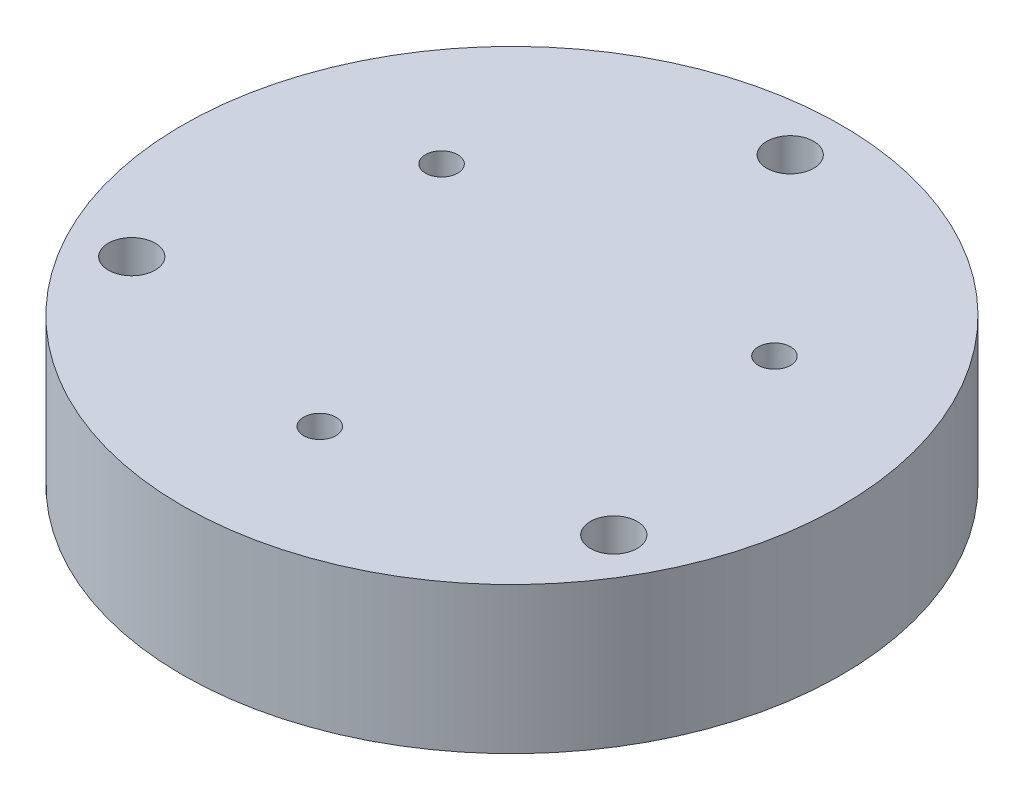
ISO-10303-21;
HEADER;
FILE_DESCRIPTION(('STEP AP214'),'2;1');
FILE_NAME('part.step','',(''),(''),'','','');
FILE_SCHEMA(('AUTOMOTIVE_DESIGN { 1 0 10303 214 1 1 1 1 }'));
ENDSEC;
DATA;
#1=APPLICATION_CONTEXT('core data for automotive mechanical design processes');
#2=APPLICATION_PROTOCOL_DEFINITION('international standard','automotive_design',2000,#1);
#3=PRODUCT_CONTEXT('',#1,'mechanical');
#4=PRODUCT('Part','Part','',(#3));
#5=PRODUCT_RELATED_PRODUCT_CATEGORY('part','',(#4));
#6=PRODUCT_DEFINITION_FORMATION('','',#4);
#7=PRODUCT_DEFINITION_CONTEXT('part definition',#1,'design');
#8=PRODUCT_DEFINITION('design','',#6,#7);
#9=PRODUCT_DEFINITION_SHAPE('','',#8);
#10=(LENGTH_UNIT() NAMED_UNIT(*) SI_UNIT(.MILLI.,.METRE.));
#11=(NAMED_UNIT(*) PLANE_ANGLE_UNIT() SI_UNIT($,.RADIAN.));
#12=(NAMED_UNIT(*) SI_UNIT($,.STERADIAN.) SOLID_ANGLE_UNIT());
#13=UNCERTAINTY_MEASURE_WITH_UNIT(LENGTH_MEASURE(1.E-05),#10,'distance_accuracy_value','');
#14=(GEOMETRIC_REPRESENTATION_CONTEXT(3) GLOBAL_UNCERTAINTY_ASSIGNED_CONTEXT((#13)) GLOBAL_UNIT_ASSIGNED_CONTEXT((#10,
#11,#12)) REPRESENTATION_CONTEXT('',''));
#15=CARTESIAN_POINT('',(0.,0.,0.));
#16=DIRECTION('',(0.,0.,1.));
#17=DIRECTION('',(1.,0.,0.));
#18=AXIS2_PLACEMENT_3D('',#15,#16,#17);
#19=CARTESIAN_POINT('',(0.,10.,13.1192248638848));
#20=DIRECTION('',(0.,-1.,0.));
#21=DIRECTION('',(0.,0.,-1.));
#22=AXIS2_PLACEMENT_3D('',#19,#20,#21);
#23=CYLINDRICAL_SURFACE('',#22,1.1);
#24=CARTESIAN_POINT('',(0.,10.,13.1192248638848));
#25=DIRECTION('',(0.,1.,0.));
#26=DIRECTION('',(0.,0.,1.));
#27=AXIS2_PLACEMENT_3D('',#24,#25,#26);
#28=CIRCLE('',#27,1.1);
#29=CARTESIAN_POINT('',(0.,10.,14.2192248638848));
#30=VERTEX_POINT('',#29);
#31=EDGE_CURVE('E48',#30,#30,#28,.T.);
#32=ORIENTED_EDGE('',*,*,#31,.T.);
#33=EDGE_LOOP('',(#32));
#34=FACE_BOUND('',#33,.T.);
#35=CARTESIAN_POINT('',(0.,2.,13.1192248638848));
#36=DIRECTION('',(0.,-1.,0.));
#37=DIRECTION('',(0.,0.,-1.));
#38=AXIS2_PLACEMENT_3D('',#35,#36,#37);
#39=CIRCLE('',#38,1.1);
#40=CARTESIAN_POINT('',(0.,2.,12.0192248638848));
#41=VERTEX_POINT('',#40);
#42=EDGE_CURVE('E69',#41,#41,#39,.T.);
#43=ORIENTED_EDGE('',*,*,#42,.T.);
#44=EDGE_LOOP('',(#43));
#45=FACE_BOUND('',#44,.T.);
#46=ADVANCED_FACE('F28',(#34,#45),#23,.F.);
#47=CARTESIAN_POINT('',(-11.3615820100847,10.,-6.55961243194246));
#48=DIRECTION('',(0.,-1.,0.));
#49=DIRECTION('',(0.,0.,-1.));
#50=AXIS2_PLACEMENT_3D('',#47,#48,#49);
#51=CYLINDRICAL_SURFACE('',#50,1.1);
#52=CARTESIAN_POINT('',(-11.3615820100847,10.,-6.55961243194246));
#53=DIRECTION('',(0.,1.,0.));
#54=DIRECTION('',(0.,0.,1.));
#55=AXIS2_PLACEMENT_3D('',#52,#53,#54);
#56=CIRCLE('',#55,1.1);
#57=CARTESIAN_POINT('',(-11.3615820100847,10.,-5.45961243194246));
#58=VERTEX_POINT('',#57);
#59=EDGE_CURVE('E63',#58,#58,#56,.T.);
#60=ORIENTED_EDGE('',*,*,#59,.T.);
#61=EDGE_LOOP('',(#60));
#62=FACE_BOUND('',#61,.T.);
#63=CARTESIAN_POINT('',(-11.3615820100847,2.,-6.55961243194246));
#64=DIRECTION('',(0.,-1.,0.));
#65=DIRECTION('',(0.,0.,-1.));
#66=AXIS2_PLACEMENT_3D('',#63,#64,#65);
#67=CIRCLE('',#66,1.1);
#68=CARTESIAN_POINT('',(-11.3615820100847,2.,-7.65961243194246));
#69=VERTEX_POINT('',#68);
#70=EDGE_CURVE('E72',#69,#69,#67,.T.);
#71=ORIENTED_EDGE('',*,*,#70,.T.);
#72=EDGE_LOOP('',(#71));
#73=FACE_BOUND('',#72,.T.);
#74=ADVANCED_FACE('F135',(#62,#73),#51,.F.);
#75=CARTESIAN_POINT('',(11.3615820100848,10.,-6.5596124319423));
#76=DIRECTION('',(0.,-1.,0.));
#77=DIRECTION('',(0.,0.,-1.));
#78=AXIS2_PLACEMENT_3D('',#75,#76,#77);
#79=CYLINDRICAL_SURFACE('',#78,1.1);
#80=CARTESIAN_POINT('',(11.3615820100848,10.,-6.5596124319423));
#81=DIRECTION('',(0.,1.,0.));
#82=DIRECTION('',(0.,0.,1.));
#83=AXIS2_PLACEMENT_3D('',#80,#81,#82);
#84=CIRCLE('',#83,1.1);
#85=CARTESIAN_POINT('',(11.3615820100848,10.,-5.45961243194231));
#86=VERTEX_POINT('',#85);
#87=EDGE_CURVE('E66',#86,#86,#84,.T.);
#88=ORIENTED_EDGE('',*,*,#87,.T.);
#89=EDGE_LOOP('',(#88));
#90=FACE_BOUND('',#89,.T.);
#91=CARTESIAN_POINT('',(11.3615820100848,2.,-6.5596124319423));
#92=DIRECTION('',(0.,-1.,0.));
#93=DIRECTION('',(0.,0.,-1.));
#94=AXIS2_PLACEMENT_3D('',#91,#92,#93);
#95=CIRCLE('',#94,1.1);
#96=CARTESIAN_POINT('',(11.3615820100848,2.,-7.6596124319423));
#97=VERTEX_POINT('',#96);
#98=EDGE_CURVE('E32',#97,#97,#95,.T.);
#99=ORIENTED_EDGE('',*,*,#98,.T.);
#100=EDGE_LOOP('',(#99));
#101=FACE_BOUND('',#100,.T.);
#102=ADVANCED_FACE('F141',(#90,#101),#79,.F.);
#103=CARTESIAN_POINT('',(0.,10.,0.));
#104=DIRECTION('',(0.,1.,0.));
#105=DIRECTION('',(0.,0.,1.));
#106=AXIS2_PLACEMENT_3D('',#103,#104,#105);
#107=PLANE('',#106);
#108=ORIENTED_EDGE('',*,*,#59,.F.);
#109=EDGE_LOOP('',(#108));
#110=FACE_BOUND('',#109,.T.);
#111=CARTESIAN_POINT('',(16.4544826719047,10.,9.49999999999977));
#112=DIRECTION('',(0.,1.,0.));
#113=DIRECTION('',(0.,0.,1.));
#114=AXIS2_PLACEMENT_3D('',#111,#112,#113);
#115=CIRCLE('',#114,1.60000000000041);
#116=CARTESIAN_POINT('',(16.4544826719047,10.,11.1000000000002));
#117=VERTEX_POINT('',#116);
#118=EDGE_CURVE('E51',#117,#117,#115,.T.);
#119=ORIENTED_EDGE('',*,*,#118,.F.);
#120=EDGE_LOOP('',(#119));
#121=FACE_BOUND('',#120,.T.);
#122=CARTESIAN_POINT('',(0.,10.,-19.));
#123=DIRECTION('',(0.,1.,0.));
#124=DIRECTION('',(0.,0.,1.));
#125=AXIS2_PLACEMENT_3D('',#122,#123,#124);
#126=CIRCLE('',#125,1.6);
#127=CARTESIAN_POINT('',(0.,10.,-17.4));
#128=VERTEX_POINT('',#127);
#129=EDGE_CURVE('E40',#128,#128,#126,.T.);
#130=ORIENTED_EDGE('',*,*,#129,.F.);
#131=EDGE_LOOP('',(#130));
#132=FACE_BOUND('',#131,.T.);
#133=CARTESIAN_POINT('',(0.,10.,0.));
#134=DIRECTION('',(0.,1.,0.));
#135=DIRECTION('',(0.,0.,1.));
#136=AXIS2_PLACEMENT_3D('',#133,#134,#135);
#137=CIRCLE('',#136,22.5);
#138=CARTESIAN_POINT('',(0.,10.,22.5));
#139=VERTEX_POINT('',#138);
#140=EDGE_CURVE('E10',#139,#139,#137,.T.);
#141=ORIENTED_EDGE('',*,*,#140,.T.);
#142=EDGE_LOOP('',(#141));
#143=FACE_BOUND('',#142,.T.);
#144=ORIENTED_EDGE('',*,*,#31,.F.);
#145=EDGE_LOOP('',(#144));
#146=FACE_BOUND('',#145,.T.);
#147=CARTESIAN_POINT('',(-16.4544826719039,10.,9.50000000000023));
#148=DIRECTION('',(0.,1.,0.));
#149=DIRECTION('',(0.,0.,1.));
#150=AXIS2_PLACEMENT_3D('',#147,#148,#149);
#151=CIRCLE('',#150,1.60000000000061);
#152=CARTESIAN_POINT('',(-16.4544826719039,10.,11.1000000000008));
#153=VERTEX_POINT('',#152);
#154=EDGE_CURVE('E57',#153,#153,#151,.T.);
#155=ORIENTED_EDGE('',*,*,#154,.F.);
#156=EDGE_LOOP('',(#155));
#157=FACE_BOUND('',#156,.T.);
#158=ORIENTED_EDGE('',*,*,#87,.F.);
#159=EDGE_LOOP('',(#158));
#160=FACE_BOUND('',#159,.T.);
#161=ADVANCED_FACE('F113',(#110,#121,#132,#143,#146,#157,#160),#107,.T.);
#162=CARTESIAN_POINT('',(0.,0.,0.));
#163=DIRECTION('',(0.,1.,0.));
#164=DIRECTION('',(0.,0.,1.));
#165=AXIS2_PLACEMENT_3D('',#162,#163,#164);
#166=PLANE('',#165);
#167=CARTESIAN_POINT('',(0.,0.,0.));
#168=DIRECTION('',(0.,-1.,0.));
#169=DIRECTION('',(0.,0.,-1.));
#170=AXIS2_PLACEMENT_3D('',#167,#168,#169);
#171=CIRCLE('',#170,15.7);
#172=CARTESIAN_POINT('',(0.,0.,-15.7));
#173=VERTEX_POINT('',#172);
#174=EDGE_CURVE('E78',#173,#173,#171,.T.);
#175=ORIENTED_EDGE('',*,*,#174,.F.);
#176=EDGE_LOOP('',(#175));
#177=FACE_BOUND('',#176,.T.);
#178=CARTESIAN_POINT('',(16.4544826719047,0.,9.49999999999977));
#179=DIRECTION('',(0.,1.,0.));
#180=DIRECTION('',(0.,0.,1.));
#181=AXIS2_PLACEMENT_3D('',#178,#179,#180);
#182=CIRCLE('',#181,1.60000000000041);
#183=CARTESIAN_POINT('',(16.4544826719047,0.,11.1000000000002));
#184=VERTEX_POINT('',#183);
#185=EDGE_CURVE('E54',#184,#184,#182,.T.);
#186=ORIENTED_EDGE('',*,*,#185,.T.);
#187=EDGE_LOOP('',(#186));
#188=FACE_BOUND('',#187,.T.);
#189=CARTESIAN_POINT('',(0.,0.,-19.));
#190=DIRECTION('',(0.,1.,0.));
#191=DIRECTION('',(0.,0.,1.));
#192=AXIS2_PLACEMENT_3D('',#189,#190,#191);
#193=CIRCLE('',#192,1.6);
#194=CARTESIAN_POINT('',(0.,0.,-17.4));
#195=VERTEX_POINT('',#194);
#196=EDGE_CURVE('E45',#195,#195,#193,.T.);
#197=ORIENTED_EDGE('',*,*,#196,.T.);
#198=EDGE_LOOP('',(#197));
#199=FACE_BOUND('',#198,.T.);
#200=CARTESIAN_POINT('',(0.,0.,0.));
#201=DIRECTION('',(0.,1.,0.));
#202=DIRECTION('',(0.,0.,1.));
#203=AXIS2_PLACEMENT_3D('',#200,#201,#202);
#204=CIRCLE('',#203,22.5);
#205=CARTESIAN_POINT('',(0.,0.,22.5));
#206=VERTEX_POINT('',#205);
#207=EDGE_CURVE('E36',#206,#206,#204,.T.);
#208=ORIENTED_EDGE('',*,*,#207,.F.);
#209=EDGE_LOOP('',(#208));
#210=FACE_BOUND('',#209,.T.);
#211=CARTESIAN_POINT('',(-16.4544826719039,0.,9.50000000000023));
#212=DIRECTION('',(0.,1.,0.));
#213=DIRECTION('',(0.,0.,1.));
#214=AXIS2_PLACEMENT_3D('',#211,#212,#213);
#215=CIRCLE('',#214,1.60000000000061);
#216=CARTESIAN_POINT('',(-16.4544826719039,0.,11.1000000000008));
#217=VERTEX_POINT('',#216);
#218=EDGE_CURVE('E60',#217,#217,#215,.T.);
#219=ORIENTED_EDGE('',*,*,#218,.T.);
#220=EDGE_LOOP('',(#219));
#221=FACE_BOUND('',#220,.T.);
#222=ADVANCED_FACE('F110',(#177,#188,#199,#210,#221),#166,.F.);
#223=CARTESIAN_POINT('',(0.,10.,0.));
#224=DIRECTION('',(0.,-1.,0.));
#225=DIRECTION('',(0.,0.,-1.));
#226=AXIS2_PLACEMENT_3D('',#223,#224,#225);
#227=CYLINDRICAL_SURFACE('',#226,22.5);
#228=ORIENTED_EDGE('',*,*,#140,.F.);
#229=EDGE_LOOP('',(#228));
#230=FACE_BOUND('',#229,.T.);
#231=ORIENTED_EDGE('',*,*,#207,.T.);
#232=EDGE_LOOP('',(#231));
#233=FACE_BOUND('',#232,.T.);
#234=ADVANCED_FACE('F30',(#230,#233),#227,.T.);
#235=CARTESIAN_POINT('',(0.,10.,-19.));
#236=DIRECTION('',(0.,-1.,0.));
#237=DIRECTION('',(0.,0.,-1.));
#238=AXIS2_PLACEMENT_3D('',#235,#236,#237);
#239=CYLINDRICAL_SURFACE('',#238,1.6);
#240=ORIENTED_EDGE('',*,*,#129,.T.);
#241=EDGE_LOOP('',(#240));
#242=FACE_BOUND('',#241,.T.);
#243=ORIENTED_EDGE('',*,*,#196,.F.);
#244=EDGE_LOOP('',(#243));
#245=FACE_BOUND('',#244,.T.);
#246=ADVANCED_FACE('F130',(#242,#245),#239,.F.);
#247=CARTESIAN_POINT('',(16.4544826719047,10.,9.49999999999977));
#248=DIRECTION('',(0.,-1.,0.));
#249=DIRECTION('',(0.,0.,-1.));
#250=AXIS2_PLACEMENT_3D('',#247,#248,#249);
#251=CYLINDRICAL_SURFACE('',#250,1.60000000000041);
#252=ORIENTED_EDGE('',*,*,#118,.T.);
#253=EDGE_LOOP('',(#252));
#254=FACE_BOUND('',#253,.T.);
#255=ORIENTED_EDGE('',*,*,#185,.F.);
#256=EDGE_LOOP('',(#255));
#257=FACE_BOUND('',#256,.T.);
#258=ADVANCED_FACE('F124',(#254,#257),#251,.F.);
#259=CARTESIAN_POINT('',(-16.4544826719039,10.,9.50000000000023));
#260=DIRECTION('',(0.,-1.,0.));
#261=DIRECTION('',(0.,0.,-1.));
#262=AXIS2_PLACEMENT_3D('',#259,#260,#261);
#263=CYLINDRICAL_SURFACE('',#262,1.60000000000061);
#264=ORIENTED_EDGE('',*,*,#154,.T.);
#265=EDGE_LOOP('',(#264));
#266=FACE_BOUND('',#265,.T.);
#267=ORIENTED_EDGE('',*,*,#218,.F.);
#268=EDGE_LOOP('',(#267));
#269=FACE_BOUND('',#268,.T.);
#270=ADVANCED_FACE('F106',(#266,#269),#263,.F.);
#271=CARTESIAN_POINT('',(0.,2.,0.));
#272=DIRECTION('',(0.,-1.,0.));
#273=DIRECTION('',(0.,0.,-1.));
#274=AXIS2_PLACEMENT_3D('',#271,#272,#273);
#275=CYLINDRICAL_SURFACE('',#274,15.7);
#276=CARTESIAN_POINT('',(0.,2.,0.));
#277=DIRECTION('',(0.,-1.,0.));
#278=DIRECTION('',(0.,0.,-1.));
#279=AXIS2_PLACEMENT_3D('',#276,#277,#278);
#280=CIRCLE('',#279,15.7);
#281=CARTESIAN_POINT('',(0.,2.,-15.7));
#282=VERTEX_POINT('',#281);
#283=EDGE_CURVE('E75',#282,#282,#280,.T.);
#284=ORIENTED_EDGE('',*,*,#283,.F.);
#285=EDGE_LOOP('',(#284));
#286=FACE_BOUND('',#285,.T.);
#287=ORIENTED_EDGE('',*,*,#174,.T.);
#288=EDGE_LOOP('',(#287));
#289=FACE_BOUND('',#288,.T.);
#290=ADVANCED_FACE('F93',(#286,#289),#275,.F.);
#291=CARTESIAN_POINT('',(0.,2.,0.));
#292=DIRECTION('',(0.,-1.,0.));
#293=DIRECTION('',(0.,0.,-1.));
#294=AXIS2_PLACEMENT_3D('',#291,#292,#293);
#295=PLANE('',#294);
#296=CARTESIAN_POINT('',(0.,2.,0.));
#297=DIRECTION('',(0.,-1.,0.));
#298=DIRECTION('',(0.,0.,-1.));
#299=AXIS2_PLACEMENT_3D('',#296,#297,#298);
#300=CIRCLE('',#299,10.5);
#301=CARTESIAN_POINT('',(0.,2.,-10.5));
#302=VERTEX_POINT('',#301);
#303=EDGE_CURVE('E84',#302,#302,#300,.T.);
#304=ORIENTED_EDGE('',*,*,#303,.F.);
#305=EDGE_LOOP('',(#304));
#306=FACE_BOUND('',#305,.T.);
#307=ORIENTED_EDGE('',*,*,#42,.F.);
#308=EDGE_LOOP('',(#307));
#309=FACE_BOUND('',#308,.T.);
#310=ORIENTED_EDGE('',*,*,#70,.F.);
#311=EDGE_LOOP('',(#310));
#312=FACE_BOUND('',#311,.T.);
#313=ORIENTED_EDGE('',*,*,#98,.F.);
#314=EDGE_LOOP('',(#313));
#315=FACE_BOUND('',#314,.T.);
#316=ORIENTED_EDGE('',*,*,#283,.T.);
#317=EDGE_LOOP('',(#316));
#318=FACE_BOUND('',#317,.T.);
#319=ADVANCED_FACE('F90',(#306,#309,#312,#315,#318),#295,.T.);
#320=CARTESIAN_POINT('',(0.,8.,0.));
#321=DIRECTION('',(0.,-1.,0.));
#322=DIRECTION('',(0.,0.,-1.));
#323=AXIS2_PLACEMENT_3D('',#320,#321,#322);
#324=CYLINDRICAL_SURFACE('',#323,10.5);
#325=CARTESIAN_POINT('',(0.,8.,0.));
#326=DIRECTION('',(0.,-1.,0.));
#327=DIRECTION('',(0.,0.,-1.));
#328=AXIS2_PLACEMENT_3D('',#325,#326,#327);
#329=CIRCLE('',#328,10.5);
#330=CARTESIAN_POINT('',(0.,8.,-10.5));
#331=VERTEX_POINT('',#330);
#332=EDGE_CURVE('E81',#331,#331,#329,.T.);
#333=ORIENTED_EDGE('',*,*,#332,.F.);
#334=EDGE_LOOP('',(#333));
#335=FACE_BOUND('',#334,.T.);
#336=ORIENTED_EDGE('',*,*,#303,.T.);
#337=EDGE_LOOP('',(#336));
#338=FACE_BOUND('',#337,.T.);
#339=ADVANCED_FACE('F88',(#335,#338),#324,.F.);
#340=CARTESIAN_POINT('',(0.,8.,0.));
#341=DIRECTION('',(0.,-1.,0.));
#342=DIRECTION('',(0.,0.,-1.));
#343=AXIS2_PLACEMENT_3D('',#340,#341,#342);
#344=PLANE('',#343);
#345=ORIENTED_EDGE('',*,*,#332,.T.);
#346=EDGE_LOOP('',(#345));
#347=FACE_BOUND('',#346,.T.);
#348=ADVANCED_FACE('F174',(#347),#344,.T.);
#349=CLOSED_SHELL('',(#46,#74,#102,#161,#222,#234,#246,#258,#270,#290,#319,#339,#348));
#350=MANIFOLD_SOLID_BREP('B2',#349);
#351=ADVANCED_BREP_SHAPE_REPRESENTATION('',(#18,#350),#14);
#352=SHAPE_DEFINITION_REPRESENTATION(#9,#351);
ENDSEC;
END-ISO-10303-21;
